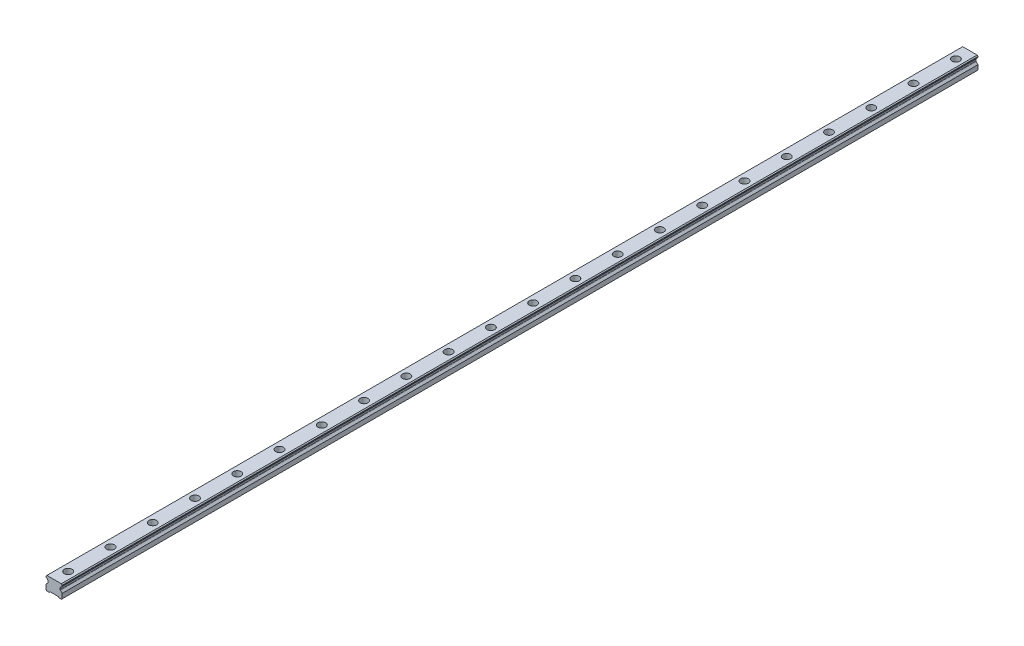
from build123d import *

# Parameters (mm, degrees)
SKETCH1_W           = 23
SKETCH1_H           = 19.2
BOSS_EXTRUDE1_DEPTH = 650
CUT_EXTRUDE1_DEPTH  = 1301.192635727
CHAMFER1_SIZE       = 1.25
FILLET1_R           = 1.25
CUT_EXTRUDE2_DEPTH  = 1301.192635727
SKETCH4_R           = 5.5
SKETCH4_R_2         = 3.5
CUT_EXTRUDE3_DEPTH  = 9
SKETCH4_2_R         = 3.5
CUT_EXTRUDE4_DEPTH  = 651.385185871
LPATTERN1_COUNT     = 22
LPATTERN1_PITCH     = 60


with BuildPart() as part:
    # Sketch1 → Boss-Extrude1 (new, symmetric)
    with BuildSketch(Plane.XY):
        with Locations((0, 9.6)):
            Rectangle(SKETCH1_W, SKETCH1_H)
    extrude(amount=BOSS_EXTRUDE1_DEPTH, both=True)

    # Sketch2 → Cut-Extrude1 (cut, through all)
    with BuildSketch(Plane.XY.offset(650)):
        Polygon((-11.5, 16.7), (-11.5, 7.95), (-8.583333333, 10.866666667), (-8.583333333, 13.783333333), align=None)
        Polygon((8.583333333, 13.783333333), (11.5, 16.7), (11.5, 7.95), (8.583333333, 10.866666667), align=None)
    extrude(amount=-CUT_EXTRUDE1_DEPTH, mode=Mode.SUBTRACT)

    # Chamfer1
    chamfer1_edges = [part.edges().sort_by_distance(p)[0] for p in [
        (-11.5, 19.2, 0),
        (11.5, 19.2, 0),
        (11.5, 0, 0),
        (-11.5, 0, 0),
    ]]
    chamfer(chamfer1_edges, length=CHAMFER1_SIZE)

    # Fillet1
    fillet1_edges = [part.edges().sort_by_distance(p)[0] for p in [
        (-8.583333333, 13.783333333, 0),
        (-8.583333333, 10.866666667, 0),
        (8.583333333, 10.866666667, 0),
        (8.583333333, 13.783333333, 0),
    ]]
    fillet(fillet1_edges, radius=FILLET1_R)

    # Sketch3 → Cut-Extrude2 (cut, through all)
    with BuildSketch(Plane.XY.offset(650)):
        Polygon((-7, 0), (-5.75, 1.25), (5.75, 1.25), (7, 0), align=None)
    extrude(amount=-CUT_EXTRUDE2_DEPTH, mode=Mode.SUBTRACT)

    # Sketch4 → Cut-Extrude3 (cut)
    with BuildSketch(Plane(origin=(0, 19.2, 0), x_dir=(1, 0, 0), z_dir=(0, 1, 0))):
        with Locations(Location((0, -630, 0), (0, 0, 270))):
            Circle(SKETCH4_R)
        with Locations(Location((0, -630, 0), (0, 0, 270))):
            Circle(SKETCH4_R_2, mode=Mode.SUBTRACT)
    cut_extrude3 = extrude(amount=-CUT_EXTRUDE3_DEPTH, mode=Mode.SUBTRACT)

    # Sketch4_2 → Cut-Extrude4 (cut, through all)
    with BuildSketch(Plane(origin=(0, 19.2, 0), x_dir=(1, 0, 0), z_dir=(0, 1, 0))):
        with Locations(Location((0, -630, 0), (0, 0, 270))):
            Circle(SKETCH4_2_R)
    cut_extrude4 = extrude(amount=-CUT_EXTRUDE4_DEPTH, mode=Mode.SUBTRACT)

    # LPattern1: Cut-Extrude3, Cut-Extrude4 ×22
    with Locations(*[(0, 0, -i * LPATTERN1_PITCH) for i in range(1, LPATTERN1_COUNT)]):
        add(cut_extrude3, mode=Mode.SUBTRACT)
        add(cut_extrude4, mode=Mode.SUBTRACT)


solid = part.part
